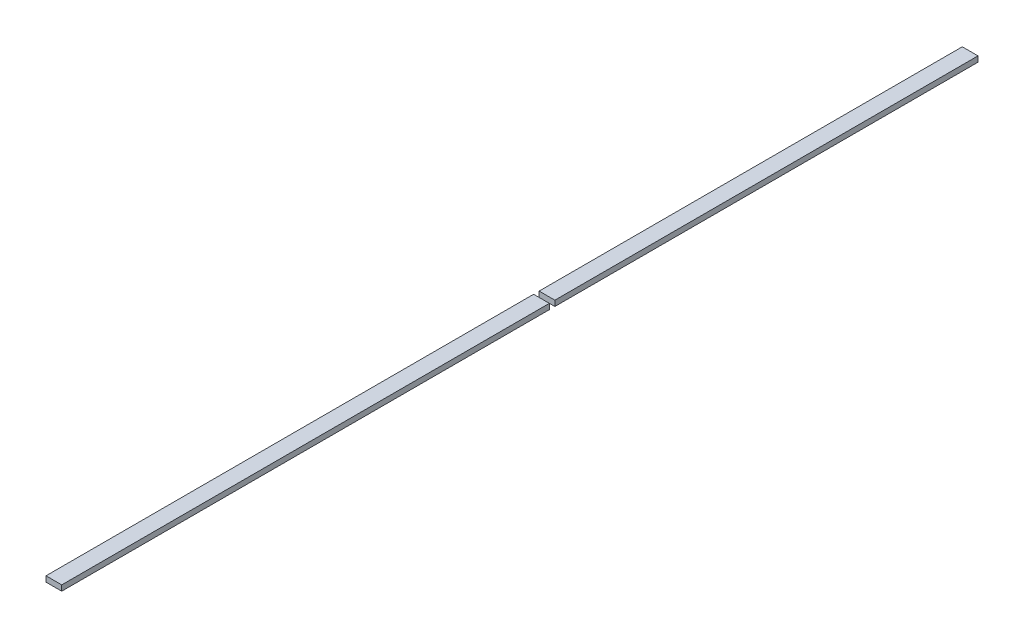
from build123d import *

# Parameters (mm, degrees)
SKETCH1_W           = 40
SKETCH1_H           = 14
BOSS_EXTRUDE1_DEPTH = 1165
SKETCH2_W           = 40
SKETCH2_H           = 14
CUT_EXTRUDE1_DEPTH  = 1166.255765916


with BuildPart() as part:
    # Sketch1 → Boss-Extrude1 (new, symmetric)
    with BuildSketch(Plane.XY):
        Rectangle(SKETCH1_W, SKETCH1_H)
    extrude(amount=BOSS_EXTRUDE1_DEPTH, both=True)

    # Sketch2 → Cut-Extrude1 (cut, through all)
    with BuildSketch(Plane.XZ.offset(7)):
        with Locations((0, -82)):
            Rectangle(SKETCH2_W, SKETCH2_H)
    extrude(amount=-CUT_EXTRUDE1_DEPTH, mode=Mode.SUBTRACT)


with BuildPart() as cut_extrude1_piece_1:
    # of the separate pieces the step leaves, piece 1, a body of its own (cut_extrude1_pieces)
    add(part.part.solids().sort_by_distance((-20, -7, 1165))[0])


with BuildPart() as cut_extrude1_piece_2:
    # of the separate pieces the step leaves, piece 2, a body of its own (cut_extrude1_pieces)
    add(part.part.solids().sort_by_distance((-20, -7, -89))[0])


solid = Compound([cut_extrude1_piece_1.part, cut_extrude1_piece_2.part])
